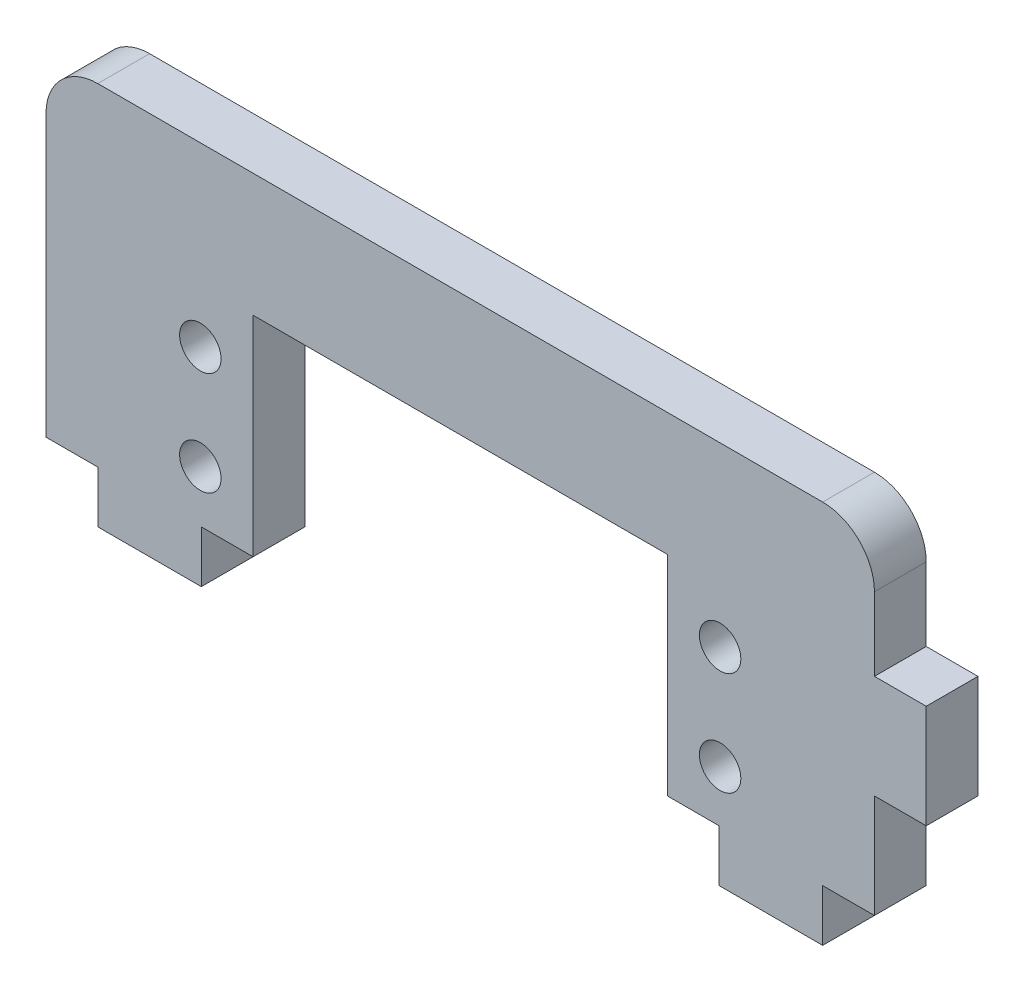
ISO-10303-21;
HEADER;
FILE_DESCRIPTION(('STEP AP214'),'2;1');
FILE_NAME('part.step','',(''),(''),'','','');
FILE_SCHEMA(('AUTOMOTIVE_DESIGN { 1 0 10303 214 1 1 1 1 }'));
ENDSEC;
DATA;
#1=APPLICATION_CONTEXT('core data for automotive mechanical design processes');
#2=APPLICATION_PROTOCOL_DEFINITION('international standard','automotive_design',2000,#1);
#3=PRODUCT_CONTEXT('',#1,'mechanical');
#4=PRODUCT('Part','Part','',(#3));
#5=PRODUCT_RELATED_PRODUCT_CATEGORY('part','',(#4));
#6=PRODUCT_DEFINITION_FORMATION('','',#4);
#7=PRODUCT_DEFINITION_CONTEXT('part definition',#1,'design');
#8=PRODUCT_DEFINITION('design','',#6,#7);
#9=PRODUCT_DEFINITION_SHAPE('','',#8);
#10=(LENGTH_UNIT() NAMED_UNIT(*) SI_UNIT(.MILLI.,.METRE.));
#11=(NAMED_UNIT(*) PLANE_ANGLE_UNIT() SI_UNIT($,.RADIAN.));
#12=(NAMED_UNIT(*) SI_UNIT($,.STERADIAN.) SOLID_ANGLE_UNIT());
#13=UNCERTAINTY_MEASURE_WITH_UNIT(LENGTH_MEASURE(1.E-05),#10,'distance_accuracy_value','');
#14=(GEOMETRIC_REPRESENTATION_CONTEXT(3) GLOBAL_UNCERTAINTY_ASSIGNED_CONTEXT((#13)) GLOBAL_UNIT_ASSIGNED_CONTEXT((#10,
#11,#12)) REPRESENTATION_CONTEXT('',''));
#15=CARTESIAN_POINT('',(0.,0.,0.));
#16=DIRECTION('',(0.,0.,1.));
#17=DIRECTION('',(1.,0.,0.));
#18=AXIS2_PLACEMENT_3D('',#15,#16,#17);
#19=CARTESIAN_POINT('',(80.,0.,5.));
#20=DIRECTION('',(-1.,0.,0.));
#21=DIRECTION('',(0.,0.,1.));
#22=AXIS2_PLACEMENT_3D('',#19,#20,#21);
#23=PLANE('',#22);
#24=DIRECTION('',(0.,0.,-1.));
#25=VECTOR('',#24,1.);
#26=CARTESIAN_POINT('',(80.,10.,5.));
#27=LINE('',#26,#25);
#28=CARTESIAN_POINT('',(80.,10.,5.));
#29=VERTEX_POINT('',#28);
#30=CARTESIAN_POINT('',(80.,10.,0.));
#31=VERTEX_POINT('',#30);
#32=EDGE_CURVE('E56',#29,#31,#27,.T.);
#33=ORIENTED_EDGE('',*,*,#32,.F.);
#34=DIRECTION('',(0.,1.,0.));
#35=VECTOR('',#34,1.);
#36=CARTESIAN_POINT('',(80.,0.,5.));
#37=LINE('',#36,#35);
#38=CARTESIAN_POINT('',(80.,0.,5.));
#39=VERTEX_POINT('',#38);
#40=EDGE_CURVE('E207',#39,#29,#37,.T.);
#41=ORIENTED_EDGE('',*,*,#40,.F.);
#42=DIRECTION('',(0.,0.,-1.));
#43=VECTOR('',#42,1.);
#44=CARTESIAN_POINT('',(80.,0.,5.));
#45=LINE('',#44,#43);
#46=CARTESIAN_POINT('',(80.,0.,0.));
#47=VERTEX_POINT('',#46);
#48=EDGE_CURVE('E350',#39,#47,#45,.T.);
#49=ORIENTED_EDGE('',*,*,#48,.T.);
#50=DIRECTION('',(0.,1.,0.));
#51=VECTOR('',#50,1.);
#52=CARTESIAN_POINT('',(80.,0.,0.));
#53=LINE('',#52,#51);
#54=EDGE_CURVE('E332',#47,#31,#53,.T.);
#55=ORIENTED_EDGE('',*,*,#54,.T.);
#56=EDGE_LOOP('',(#33,#41,#49,#55));
#57=FACE_BOUND('',#56,.T.);
#58=ADVANCED_FACE('F33',(#57),#23,.F.);
#59=DIRECTION('',(0.,0.,1.));
#60=VECTOR('',#59,1.);
#61=CARTESIAN_POINT('',(80.,20.,5.));
#62=LINE('',#61,#60);
#63=CARTESIAN_POINT('',(80.,20.,0.));
#64=VERTEX_POINT('',#63);
#65=CARTESIAN_POINT('',(80.,20.,5.));
#66=VERTEX_POINT('',#65);
#67=EDGE_CURVE('E203',#64,#66,#62,.T.);
#68=ORIENTED_EDGE('',*,*,#67,.F.);
#69=CARTESIAN_POINT('',(80.,27.0753073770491,0.));
#70=VERTEX_POINT('',#69);
#71=EDGE_CURVE('E331',#64,#70,#53,.T.);
#72=ORIENTED_EDGE('',*,*,#71,.T.);
#73=DIRECTION('',(0.,0.,-1.));
#74=VECTOR('',#73,1.);
#75=CARTESIAN_POINT('',(80.,27.0753073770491,5.));
#76=LINE('',#75,#74);
#77=CARTESIAN_POINT('',(80.,27.0753073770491,5.));
#78=VERTEX_POINT('',#77);
#79=EDGE_CURVE('E347',#78,#70,#76,.T.);
#80=ORIENTED_EDGE('',*,*,#79,.F.);
#81=EDGE_CURVE('E48',#66,#78,#37,.T.);
#82=ORIENTED_EDGE('',*,*,#81,.F.);
#83=EDGE_LOOP('',(#68,#72,#80,#82));
#84=FACE_BOUND('',#83,.T.);
#85=ADVANCED_FACE('F422',(#84),#23,.F.);
#86=CARTESIAN_POINT('',(60.,0.,5.));
#87=DIRECTION('',(0.,1.,0.));
#88=DIRECTION('',(0.,0.,1.));
#89=AXIS2_PLACEMENT_3D('',#86,#87,#88);
#90=PLANE('',#89);
#91=DIRECTION('',(0.,0.,-1.));
#92=VECTOR('',#91,1.);
#93=CARTESIAN_POINT('',(65.,0.,5.));
#94=LINE('',#93,#92);
#95=CARTESIAN_POINT('',(65.,0.,5.));
#96=VERTEX_POINT('',#95);
#97=CARTESIAN_POINT('',(65.,0.,0.));
#98=VERTEX_POINT('',#97);
#99=EDGE_CURVE('E208',#96,#98,#94,.T.);
#100=ORIENTED_EDGE('',*,*,#99,.F.);
#101=DIRECTION('',(1.,0.,0.));
#102=VECTOR('',#101,1.);
#103=CARTESIAN_POINT('',(60.,0.,5.));
#104=LINE('',#103,#102);
#105=CARTESIAN_POINT('',(60.,0.,5.));
#106=VERTEX_POINT('',#105);
#107=EDGE_CURVE('E306',#106,#96,#104,.T.);
#108=ORIENTED_EDGE('',*,*,#107,.F.);
#109=DIRECTION('',(0.,0.,-1.));
#110=VECTOR('',#109,1.);
#111=CARTESIAN_POINT('',(60.,0.,5.));
#112=LINE('',#111,#110);
#113=CARTESIAN_POINT('',(60.,0.,0.));
#114=VERTEX_POINT('',#113);
#115=EDGE_CURVE('E353',#106,#114,#112,.T.);
#116=ORIENTED_EDGE('',*,*,#115,.T.);
#117=DIRECTION('',(1.,0.,0.));
#118=VECTOR('',#117,1.);
#119=CARTESIAN_POINT('',(60.,0.,0.));
#120=LINE('',#119,#118);
#121=EDGE_CURVE('E329',#114,#98,#120,.T.);
#122=ORIENTED_EDGE('',*,*,#121,.T.);
#123=EDGE_LOOP('',(#100,#108,#116,#122));
#124=FACE_BOUND('',#123,.T.);
#125=ADVANCED_FACE('F449',(#124),#90,.F.);
#126=DIRECTION('',(0.,0.,1.));
#127=VECTOR('',#126,1.);
#128=CARTESIAN_POINT('',(75.,0.,5.));
#129=LINE('',#128,#127);
#130=CARTESIAN_POINT('',(75.,0.,0.));
#131=VERTEX_POINT('',#130);
#132=CARTESIAN_POINT('',(75.,0.,5.));
#133=VERTEX_POINT('',#132);
#134=EDGE_CURVE('E211',#131,#133,#129,.T.);
#135=ORIENTED_EDGE('',*,*,#134,.F.);
#136=EDGE_CURVE('E328',#131,#47,#120,.T.);
#137=ORIENTED_EDGE('',*,*,#136,.T.);
#138=ORIENTED_EDGE('',*,*,#48,.F.);
#139=EDGE_CURVE('E305',#133,#39,#104,.T.);
#140=ORIENTED_EDGE('',*,*,#139,.F.);
#141=EDGE_LOOP('',(#135,#137,#138,#140));
#142=FACE_BOUND('',#141,.T.);
#143=ADVANCED_FACE('F436',(#142),#90,.F.);
#144=CARTESIAN_POINT('',(0.,0.,5.));
#145=DIRECTION('',(0.,1.,0.));
#146=DIRECTION('',(0.,0.,1.));
#147=AXIS2_PLACEMENT_3D('',#144,#145,#146);
#148=PLANE('',#147);
#149=DIRECTION('',(0.,0.,-1.));
#150=VECTOR('',#149,1.);
#151=CARTESIAN_POINT('',(5.,0.,5.));
#152=LINE('',#151,#150);
#153=CARTESIAN_POINT('',(5.,0.,5.));
#154=VERTEX_POINT('',#153);
#155=CARTESIAN_POINT('',(5.,0.,0.));
#156=VERTEX_POINT('',#155);
#157=EDGE_CURVE('E240',#154,#156,#152,.T.);
#158=ORIENTED_EDGE('',*,*,#157,.F.);
#159=DIRECTION('',(1.,0.,0.));
#160=VECTOR('',#159,1.);
#161=CARTESIAN_POINT('',(0.,0.,5.));
#162=LINE('',#161,#160);
#163=CARTESIAN_POINT('',(0.,0.,5.));
#164=VERTEX_POINT('',#163);
#165=EDGE_CURVE('E296',#164,#154,#162,.T.);
#166=ORIENTED_EDGE('',*,*,#165,.F.);
#167=DIRECTION('',(0.,0.,-1.));
#168=VECTOR('',#167,1.);
#169=CARTESIAN_POINT('',(0.,0.,5.));
#170=LINE('',#169,#168);
#171=CARTESIAN_POINT('',(0.,0.,0.));
#172=VERTEX_POINT('',#171);
#173=EDGE_CURVE('E11',#164,#172,#170,.T.);
#174=ORIENTED_EDGE('',*,*,#173,.T.);
#175=DIRECTION('',(1.,0.,0.));
#176=VECTOR('',#175,1.);
#177=CARTESIAN_POINT('',(0.,0.,0.));
#178=LINE('',#177,#176);
#179=EDGE_CURVE('E320',#172,#156,#178,.T.);
#180=ORIENTED_EDGE('',*,*,#179,.T.);
#181=EDGE_LOOP('',(#158,#166,#174,#180));
#182=FACE_BOUND('',#181,.T.);
#183=ADVANCED_FACE('F401',(#182),#148,.F.);
#184=DIRECTION('',(0.,0.,1.));
#185=VECTOR('',#184,1.);
#186=CARTESIAN_POINT('',(15.,0.,5.));
#187=LINE('',#186,#185);
#188=CARTESIAN_POINT('',(15.,0.,0.));
#189=VERTEX_POINT('',#188);
#190=CARTESIAN_POINT('',(15.,0.,5.));
#191=VERTEX_POINT('',#190);
#192=EDGE_CURVE('E245',#189,#191,#187,.T.);
#193=ORIENTED_EDGE('',*,*,#192,.F.);
#194=CARTESIAN_POINT('',(20.,0.,0.));
#195=VERTEX_POINT('',#194);
#196=EDGE_CURVE('E319',#189,#195,#178,.T.);
#197=ORIENTED_EDGE('',*,*,#196,.T.);
#198=DIRECTION('',(0.,0.,-1.));
#199=VECTOR('',#198,1.);
#200=CARTESIAN_POINT('',(20.,0.,5.));
#201=LINE('',#200,#199);
#202=CARTESIAN_POINT('',(20.,0.,5.));
#203=VERTEX_POINT('',#202);
#204=EDGE_CURVE('E41',#203,#195,#201,.T.);
#205=ORIENTED_EDGE('',*,*,#204,.F.);
#206=EDGE_CURVE('E294',#191,#203,#162,.T.);
#207=ORIENTED_EDGE('',*,*,#206,.F.);
#208=EDGE_LOOP('',(#193,#197,#205,#207));
#209=FACE_BOUND('',#208,.T.);
#210=ADVANCED_FACE('F389',(#209),#148,.F.);
#211=CARTESIAN_POINT('',(0.,0.,5.));
#212=DIRECTION('',(1.,0.,0.));
#213=DIRECTION('',(0.,0.,-1.));
#214=AXIS2_PLACEMENT_3D('',#211,#212,#213);
#215=PLANE('',#214);
#216=DIRECTION('',(0.,-1.,0.));
#217=VECTOR('',#216,1.);
#218=CARTESIAN_POINT('',(0.,0.,0.));
#219=LINE('',#218,#217);
#220=CARTESIAN_POINT('',(0.,27.0753073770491,0.));
#221=VERTEX_POINT('',#220);
#222=EDGE_CURVE('E289',#221,#172,#219,.T.);
#223=ORIENTED_EDGE('',*,*,#222,.T.);
#224=ORIENTED_EDGE('',*,*,#173,.F.);
#225=DIRECTION('',(0.,-1.,0.));
#226=VECTOR('',#225,1.);
#227=CARTESIAN_POINT('',(0.,0.,5.));
#228=LINE('',#227,#226);
#229=CARTESIAN_POINT('',(0.,27.0753073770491,5.));
#230=VERTEX_POINT('',#229);
#231=EDGE_CURVE('E292',#230,#164,#228,.T.);
#232=ORIENTED_EDGE('',*,*,#231,.F.);
#233=DIRECTION('',(0.,0.,-1.));
#234=VECTOR('',#233,1.);
#235=CARTESIAN_POINT('',(0.,27.0753073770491,5.));
#236=LINE('',#235,#234);
#237=EDGE_CURVE('E316',#230,#221,#236,.T.);
#238=ORIENTED_EDGE('',*,*,#237,.T.);
#239=EDGE_LOOP('',(#223,#224,#232,#238));
#240=FACE_BOUND('',#239,.T.);
#241=ADVANCED_FACE('F35',(#240),#215,.F.);
#242=CARTESIAN_POINT('',(20.,0.,5.));
#243=DIRECTION('',(-1.,0.,0.));
#244=DIRECTION('',(0.,0.,1.));
#245=AXIS2_PLACEMENT_3D('',#242,#243,#244);
#246=PLANE('',#245);
#247=DIRECTION('',(0.,1.,0.));
#248=VECTOR('',#247,1.);
#249=CARTESIAN_POINT('',(20.,0.,0.));
#250=LINE('',#249,#248);
#251=CARTESIAN_POINT('',(20.,20.2,0.));
#252=VERTEX_POINT('',#251);
#253=EDGE_CURVE('E322',#195,#252,#250,.T.);
#254=ORIENTED_EDGE('',*,*,#253,.T.);
#255=DIRECTION('',(0.,0.,-1.));
#256=VECTOR('',#255,1.);
#257=CARTESIAN_POINT('',(20.,20.2,5.));
#258=LINE('',#257,#256);
#259=CARTESIAN_POINT('',(20.,20.2,5.));
#260=VERTEX_POINT('',#259);
#261=EDGE_CURVE('E359',#260,#252,#258,.T.);
#262=ORIENTED_EDGE('',*,*,#261,.F.);
#263=DIRECTION('',(0.,1.,0.));
#264=VECTOR('',#263,1.);
#265=CARTESIAN_POINT('',(20.,0.,5.));
#266=LINE('',#265,#264);
#267=EDGE_CURVE('E299',#203,#260,#266,.T.);
#268=ORIENTED_EDGE('',*,*,#267,.F.);
#269=ORIENTED_EDGE('',*,*,#204,.T.);
#270=EDGE_LOOP('',(#254,#262,#268,#269));
#271=FACE_BOUND('',#270,.T.);
#272=ADVANCED_FACE('F366',(#271),#246,.F.);
#273=CARTESIAN_POINT('',(20.,20.2,5.));
#274=DIRECTION('',(0.,1.,0.));
#275=DIRECTION('',(0.,0.,1.));
#276=AXIS2_PLACEMENT_3D('',#273,#274,#275);
#277=PLANE('',#276);
#278=DIRECTION('',(1.,0.,0.));
#279=VECTOR('',#278,1.);
#280=CARTESIAN_POINT('',(20.,20.2,0.));
#281=LINE('',#280,#279);
#282=CARTESIAN_POINT('',(60.,20.2,0.));
#283=VERTEX_POINT('',#282);
#284=EDGE_CURVE('E324',#252,#283,#281,.T.);
#285=ORIENTED_EDGE('',*,*,#284,.T.);
#286=DIRECTION('',(0.,0.,-1.));
#287=VECTOR('',#286,1.);
#288=CARTESIAN_POINT('',(60.,20.2,5.));
#289=LINE('',#288,#287);
#290=CARTESIAN_POINT('',(60.,20.2,5.));
#291=VERTEX_POINT('',#290);
#292=EDGE_CURVE('E356',#291,#283,#289,.T.);
#293=ORIENTED_EDGE('',*,*,#292,.F.);
#294=DIRECTION('',(1.,0.,0.));
#295=VECTOR('',#294,1.);
#296=CARTESIAN_POINT('',(20.,20.2,5.));
#297=LINE('',#296,#295);
#298=EDGE_CURVE('E301',#260,#291,#297,.T.);
#299=ORIENTED_EDGE('',*,*,#298,.F.);
#300=ORIENTED_EDGE('',*,*,#261,.T.);
#301=EDGE_LOOP('',(#285,#293,#299,#300));
#302=FACE_BOUND('',#301,.T.);
#303=ADVANCED_FACE('F379',(#302),#277,.F.);
#304=CARTESIAN_POINT('',(60.,0.,5.));
#305=DIRECTION('',(1.,0.,0.));
#306=DIRECTION('',(0.,0.,-1.));
#307=AXIS2_PLACEMENT_3D('',#304,#305,#306);
#308=PLANE('',#307);
#309=DIRECTION('',(0.,-1.,0.));
#310=VECTOR('',#309,1.);
#311=CARTESIAN_POINT('',(60.,0.,0.));
#312=LINE('',#311,#310);
#313=EDGE_CURVE('E326',#283,#114,#312,.T.);
#314=ORIENTED_EDGE('',*,*,#313,.T.);
#315=ORIENTED_EDGE('',*,*,#115,.F.);
#316=DIRECTION('',(0.,-1.,0.));
#317=VECTOR('',#316,1.);
#318=CARTESIAN_POINT('',(60.,0.,5.));
#319=LINE('',#318,#317);
#320=EDGE_CURVE('E303',#291,#106,#319,.T.);
#321=ORIENTED_EDGE('',*,*,#320,.F.);
#322=ORIENTED_EDGE('',*,*,#292,.T.);
#323=EDGE_LOOP('',(#314,#315,#321,#322));
#324=FACE_BOUND('',#323,.T.);
#325=ADVANCED_FACE('F383',(#324),#308,.F.);
#326=CARTESIAN_POINT('',(75.,27.0753073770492,5.));
#327=DIRECTION('',(0.,0.,-1.));
#328=DIRECTION('',(-1.,0.,0.));
#329=AXIS2_PLACEMENT_3D('',#326,#327,#328);
#330=CYLINDRICAL_SURFACE('',#329,5.);
#331=CARTESIAN_POINT('',(75.,27.0753073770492,0.));
#332=DIRECTION('',(0.,0.,1.));
#333=DIRECTION('',(-1.,0.,0.));
#334=AXIS2_PLACEMENT_3D('',#331,#332,#333);
#335=CIRCLE('',#334,5.);
#336=CARTESIAN_POINT('',(75.,32.0753073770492,0.));
#337=VERTEX_POINT('',#336);
#338=EDGE_CURVE('E334',#70,#337,#335,.T.);
#339=ORIENTED_EDGE('',*,*,#338,.T.);
#340=DIRECTION('',(0.,0.,-1.));
#341=VECTOR('',#340,1.);
#342=CARTESIAN_POINT('',(75.,32.0753073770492,5.));
#343=LINE('',#342,#341);
#344=CARTESIAN_POINT('',(75.,32.0753073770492,5.));
#345=VERTEX_POINT('',#344);
#346=EDGE_CURVE('E344',#345,#337,#343,.T.);
#347=ORIENTED_EDGE('',*,*,#346,.F.);
#348=CARTESIAN_POINT('',(75.,27.0753073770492,5.));
#349=DIRECTION('',(0.,0.,1.));
#350=DIRECTION('',(-1.,0.,0.));
#351=AXIS2_PLACEMENT_3D('',#348,#349,#350);
#352=CIRCLE('',#351,5.);
#353=EDGE_CURVE('E310',#78,#345,#352,.T.);
#354=ORIENTED_EDGE('',*,*,#353,.F.);
#355=ORIENTED_EDGE('',*,*,#79,.T.);
#356=EDGE_LOOP('',(#339,#347,#354,#355));
#357=FACE_BOUND('',#356,.T.);
#358=ADVANCED_FACE('F419',(#357),#330,.T.);
#359=CARTESIAN_POINT('',(5.00000000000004,32.0753073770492,5.));
#360=DIRECTION('',(0.,-1.,0.));
#361=DIRECTION('',(0.,0.,-1.));
#362=AXIS2_PLACEMENT_3D('',#359,#360,#361);
#363=PLANE('',#362);
#364=DIRECTION('',(-1.,0.,0.));
#365=VECTOR('',#364,1.);
#366=CARTESIAN_POINT('',(5.00000000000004,32.0753073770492,0.));
#367=LINE('',#366,#365);
#368=CARTESIAN_POINT('',(5.00000000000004,32.0753073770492,0.));
#369=VERTEX_POINT('',#368);
#370=EDGE_CURVE('E336',#337,#369,#367,.T.);
#371=ORIENTED_EDGE('',*,*,#370,.T.);
#372=DIRECTION('',(0.,0.,-1.));
#373=VECTOR('',#372,1.);
#374=CARTESIAN_POINT('',(5.00000000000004,32.0753073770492,5.));
#375=LINE('',#374,#373);
#376=CARTESIAN_POINT('',(5.00000000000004,32.0753073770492,5.));
#377=VERTEX_POINT('',#376);
#378=EDGE_CURVE('E341',#377,#369,#375,.T.);
#379=ORIENTED_EDGE('',*,*,#378,.F.);
#380=DIRECTION('',(-1.,0.,0.));
#381=VECTOR('',#380,1.);
#382=CARTESIAN_POINT('',(5.00000000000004,32.0753073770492,5.));
#383=LINE('',#382,#381);
#384=EDGE_CURVE('E312',#345,#377,#383,.T.);
#385=ORIENTED_EDGE('',*,*,#384,.F.);
#386=ORIENTED_EDGE('',*,*,#346,.T.);
#387=EDGE_LOOP('',(#371,#379,#385,#386));
#388=FACE_BOUND('',#387,.T.);
#389=ADVANCED_FACE('F415',(#388),#363,.F.);
#390=CARTESIAN_POINT('',(5.,27.0753073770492,5.));
#391=DIRECTION('',(0.,0.,-1.));
#392=DIRECTION('',(-1.,0.,0.));
#393=AXIS2_PLACEMENT_3D('',#390,#391,#392);
#394=CYLINDRICAL_SURFACE('',#393,5.);
#395=CARTESIAN_POINT('',(5.,27.0753073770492,0.));
#396=DIRECTION('',(0.,0.,1.));
#397=DIRECTION('',(-1.,0.,0.));
#398=AXIS2_PLACEMENT_3D('',#395,#396,#397);
#399=CIRCLE('',#398,5.);
#400=EDGE_CURVE('E295',#369,#221,#399,.T.);
#401=ORIENTED_EDGE('',*,*,#400,.T.);
#402=ORIENTED_EDGE('',*,*,#237,.F.);
#403=CARTESIAN_POINT('',(5.,27.0753073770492,5.));
#404=DIRECTION('',(0.,0.,1.));
#405=DIRECTION('',(-1.,0.,0.));
#406=AXIS2_PLACEMENT_3D('',#403,#404,#405);
#407=CIRCLE('',#406,5.);
#408=EDGE_CURVE('E314',#377,#230,#407,.T.);
#409=ORIENTED_EDGE('',*,*,#408,.F.);
#410=ORIENTED_EDGE('',*,*,#378,.T.);
#411=EDGE_LOOP('',(#401,#402,#409,#410));
#412=FACE_BOUND('',#411,.T.);
#413=ADVANCED_FACE('F411',(#412),#394,.T.);
#414=CARTESIAN_POINT('',(5.,27.0753073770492,5.));
#415=DIRECTION('',(0.,0.,-1.));
#416=DIRECTION('',(-1.,0.,0.));
#417=AXIS2_PLACEMENT_3D('',#414,#415,#416);
#418=PLANE('',#417);
#419=CARTESIAN_POINT('',(14.9028967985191,15.,5.));
#420=DIRECTION('',(0.,0.,1.));
#421=DIRECTION('',(-1.,0.,0.));
#422=AXIS2_PLACEMENT_3D('',#419,#420,#421);
#423=CIRCLE('',#422,2.);
#424=CARTESIAN_POINT('',(12.9028967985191,15.,5.));
#425=VERTEX_POINT('',#424);
#426=EDGE_CURVE('E267',#425,#425,#423,.T.);
#427=ORIENTED_EDGE('',*,*,#426,.F.);
#428=EDGE_LOOP('',(#427));
#429=FACE_BOUND('',#428,.T.);
#430=CARTESIAN_POINT('',(14.9028967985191,4.99999999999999,5.));
#431=DIRECTION('',(0.,0.,1.));
#432=DIRECTION('',(-1.,0.,0.));
#433=AXIS2_PLACEMENT_3D('',#430,#431,#432);
#434=CIRCLE('',#433,2.);
#435=CARTESIAN_POINT('',(12.9028967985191,4.99999999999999,5.));
#436=VERTEX_POINT('',#435);
#437=EDGE_CURVE('E271',#436,#436,#434,.T.);
#438=ORIENTED_EDGE('',*,*,#437,.F.);
#439=EDGE_LOOP('',(#438));
#440=FACE_BOUND('',#439,.T.);
#441=CARTESIAN_POINT('',(65.0971032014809,5.,5.));
#442=DIRECTION('',(0.,0.,1.));
#443=DIRECTION('',(1.,0.,0.));
#444=AXIS2_PLACEMENT_3D('',#441,#442,#443);
#445=CIRCLE('',#444,2.);
#446=CARTESIAN_POINT('',(67.0971032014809,5.,5.));
#447=VERTEX_POINT('',#446);
#448=EDGE_CURVE('E277',#447,#447,#445,.T.);
#449=ORIENTED_EDGE('',*,*,#448,.F.);
#450=EDGE_LOOP('',(#449));
#451=FACE_BOUND('',#450,.T.);
#452=CARTESIAN_POINT('',(65.0971032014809,15.,5.));
#453=DIRECTION('',(0.,0.,1.));
#454=DIRECTION('',(1.,0.,0.));
#455=AXIS2_PLACEMENT_3D('',#452,#453,#454);
#456=CIRCLE('',#455,2.);
#457=CARTESIAN_POINT('',(67.0971032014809,15.,5.));
#458=VERTEX_POINT('',#457);
#459=EDGE_CURVE('E283',#458,#458,#456,.T.);
#460=ORIENTED_EDGE('',*,*,#459,.F.);
#461=EDGE_LOOP('',(#460));
#462=FACE_BOUND('',#461,.T.);
#463=ORIENTED_EDGE('',*,*,#231,.T.);
#464=ORIENTED_EDGE('',*,*,#165,.T.);
#465=DIRECTION('',(0.,1.,0.));
#466=VECTOR('',#465,1.);
#467=CARTESIAN_POINT('',(5.,-5.,5.));
#468=LINE('',#467,#466);
#469=CARTESIAN_POINT('',(5.,-5.,5.));
#470=VERTEX_POINT('',#469);
#471=EDGE_CURVE('E251',#470,#154,#468,.T.);
#472=ORIENTED_EDGE('',*,*,#471,.F.);
#473=DIRECTION('',(-1.,0.,0.));
#474=VECTOR('',#473,1.);
#475=CARTESIAN_POINT('',(5.,-5.,5.));
#476=LINE('',#475,#474);
#477=CARTESIAN_POINT('',(15.,-5.,5.));
#478=VERTEX_POINT('',#477);
#479=EDGE_CURVE('E249',#478,#470,#476,.T.);
#480=ORIENTED_EDGE('',*,*,#479,.F.);
#481=DIRECTION('',(0.,1.,0.));
#482=VECTOR('',#481,1.);
#483=CARTESIAN_POINT('',(15.,-5.,5.));
#484=LINE('',#483,#482);
#485=EDGE_CURVE('E258',#478,#191,#484,.T.);
#486=ORIENTED_EDGE('',*,*,#485,.T.);
#487=ORIENTED_EDGE('',*,*,#206,.T.);
#488=ORIENTED_EDGE('',*,*,#267,.T.);
#489=ORIENTED_EDGE('',*,*,#298,.T.);
#490=ORIENTED_EDGE('',*,*,#320,.T.);
#491=ORIENTED_EDGE('',*,*,#107,.T.);
#492=DIRECTION('',(0.,1.,0.));
#493=VECTOR('',#492,1.);
#494=CARTESIAN_POINT('',(65.,-5.,5.));
#495=LINE('',#494,#493);
#496=CARTESIAN_POINT('',(65.,-5.,5.));
#497=VERTEX_POINT('',#496);
#498=EDGE_CURVE('E225',#497,#96,#495,.T.);
#499=ORIENTED_EDGE('',*,*,#498,.F.);
#500=DIRECTION('',(-1.,0.,0.));
#501=VECTOR('',#500,1.);
#502=CARTESIAN_POINT('',(65.,-5.,5.));
#503=LINE('',#502,#501);
#504=CARTESIAN_POINT('',(75.,-5.,5.));
#505=VERTEX_POINT('',#504);
#506=EDGE_CURVE('E224',#505,#497,#503,.T.);
#507=ORIENTED_EDGE('',*,*,#506,.F.);
#508=DIRECTION('',(0.,1.,0.));
#509=VECTOR('',#508,1.);
#510=CARTESIAN_POINT('',(75.,-5.,5.));
#511=LINE('',#510,#509);
#512=EDGE_CURVE('E231',#505,#133,#511,.T.);
#513=ORIENTED_EDGE('',*,*,#512,.T.);
#514=ORIENTED_EDGE('',*,*,#139,.T.);
#515=ORIENTED_EDGE('',*,*,#40,.T.);
#516=DIRECTION('',(-1.,0.,0.));
#517=VECTOR('',#516,1.);
#518=CARTESIAN_POINT('',(85.,10.,5.));
#519=LINE('',#518,#517);
#520=CARTESIAN_POINT('',(85.,10.,5.));
#521=VERTEX_POINT('',#520);
#522=EDGE_CURVE('E188',#521,#29,#519,.T.);
#523=ORIENTED_EDGE('',*,*,#522,.F.);
#524=DIRECTION('',(0.,-1.,0.));
#525=VECTOR('',#524,1.);
#526=CARTESIAN_POINT('',(85.,20.,5.));
#527=LINE('',#526,#525);
#528=CARTESIAN_POINT('',(85.,20.,5.));
#529=VERTEX_POINT('',#528);
#530=EDGE_CURVE('E194',#529,#521,#527,.T.);
#531=ORIENTED_EDGE('',*,*,#530,.F.);
#532=DIRECTION('',(-1.,0.,0.));
#533=VECTOR('',#532,1.);
#534=CARTESIAN_POINT('',(85.,20.,5.));
#535=LINE('',#534,#533);
#536=EDGE_CURVE('E426',#529,#66,#535,.T.);
#537=ORIENTED_EDGE('',*,*,#536,.T.);
#538=ORIENTED_EDGE('',*,*,#81,.T.);
#539=ORIENTED_EDGE('',*,*,#353,.T.);
#540=ORIENTED_EDGE('',*,*,#384,.T.);
#541=ORIENTED_EDGE('',*,*,#408,.T.);
#542=EDGE_LOOP('',(#463,#464,#472,#480,#486,#487,#488,#489,#490,#491,#499,#507,#513,#514,#515,
#523,#531,#537,#538,#539,#540,#541));
#543=FACE_BOUND('',#542,.T.);
#544=ADVANCED_FACE('F206',(#429,#440,#451,#462,#543),#418,.F.);
#545=CARTESIAN_POINT('',(5.,27.0753073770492,0.));
#546=DIRECTION('',(0.,0.,-1.));
#547=DIRECTION('',(-1.,0.,0.));
#548=AXIS2_PLACEMENT_3D('',#545,#546,#547);
#549=PLANE('',#548);
#550=CARTESIAN_POINT('',(14.9028967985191,15.,0.));
#551=DIRECTION('',(0.,0.,1.));
#552=DIRECTION('',(-1.,0.,0.));
#553=AXIS2_PLACEMENT_3D('',#550,#551,#552);
#554=CIRCLE('',#553,2.);
#555=CARTESIAN_POINT('',(12.9028967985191,15.,0.));
#556=VERTEX_POINT('',#555);
#557=EDGE_CURVE('E268',#556,#556,#554,.T.);
#558=ORIENTED_EDGE('',*,*,#557,.T.);
#559=EDGE_LOOP('',(#558));
#560=FACE_BOUND('',#559,.T.);
#561=CARTESIAN_POINT('',(14.9028967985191,4.99999999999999,0.));
#562=DIRECTION('',(0.,0.,1.));
#563=DIRECTION('',(-1.,0.,0.));
#564=AXIS2_PLACEMENT_3D('',#561,#562,#563);
#565=CIRCLE('',#564,2.);
#566=CARTESIAN_POINT('',(12.9028967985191,4.99999999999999,0.));
#567=VERTEX_POINT('',#566);
#568=EDGE_CURVE('E274',#567,#567,#565,.T.);
#569=ORIENTED_EDGE('',*,*,#568,.T.);
#570=EDGE_LOOP('',(#569));
#571=FACE_BOUND('',#570,.T.);
#572=CARTESIAN_POINT('',(65.0971032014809,5.,0.));
#573=DIRECTION('',(0.,0.,1.));
#574=DIRECTION('',(1.,0.,0.));
#575=AXIS2_PLACEMENT_3D('',#572,#573,#574);
#576=CIRCLE('',#575,2.);
#577=CARTESIAN_POINT('',(67.0971032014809,5.,0.));
#578=VERTEX_POINT('',#577);
#579=EDGE_CURVE('E280',#578,#578,#576,.T.);
#580=ORIENTED_EDGE('',*,*,#579,.T.);
#581=EDGE_LOOP('',(#580));
#582=FACE_BOUND('',#581,.T.);
#583=CARTESIAN_POINT('',(65.0971032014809,15.,0.));
#584=DIRECTION('',(0.,0.,1.));
#585=DIRECTION('',(1.,0.,0.));
#586=AXIS2_PLACEMENT_3D('',#583,#584,#585);
#587=CIRCLE('',#586,2.);
#588=CARTESIAN_POINT('',(67.0971032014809,15.,0.));
#589=VERTEX_POINT('',#588);
#590=EDGE_CURVE('E286',#589,#589,#587,.T.);
#591=ORIENTED_EDGE('',*,*,#590,.T.);
#592=EDGE_LOOP('',(#591));
#593=FACE_BOUND('',#592,.T.);
#594=ORIENTED_EDGE('',*,*,#222,.F.);
#595=ORIENTED_EDGE('',*,*,#400,.F.);
#596=ORIENTED_EDGE('',*,*,#370,.F.);
#597=ORIENTED_EDGE('',*,*,#338,.F.);
#598=ORIENTED_EDGE('',*,*,#71,.F.);
#599=DIRECTION('',(-1.,0.,0.));
#600=VECTOR('',#599,1.);
#601=CARTESIAN_POINT('',(85.,20.,0.));
#602=LINE('',#601,#600);
#603=CARTESIAN_POINT('',(85.,20.,0.));
#604=VERTEX_POINT('',#603);
#605=EDGE_CURVE('E213',#604,#64,#602,.T.);
#606=ORIENTED_EDGE('',*,*,#605,.F.);
#607=DIRECTION('',(0.,1.,0.));
#608=VECTOR('',#607,1.);
#609=CARTESIAN_POINT('',(85.,20.,0.));
#610=LINE('',#609,#608);
#611=CARTESIAN_POINT('',(85.,10.,0.));
#612=VERTEX_POINT('',#611);
#613=EDGE_CURVE('E193',#612,#604,#610,.T.);
#614=ORIENTED_EDGE('',*,*,#613,.F.);
#615=DIRECTION('',(-1.,0.,0.));
#616=VECTOR('',#615,1.);
#617=CARTESIAN_POINT('',(85.,10.,0.));
#618=LINE('',#617,#616);
#619=EDGE_CURVE('E190',#612,#31,#618,.T.);
#620=ORIENTED_EDGE('',*,*,#619,.T.);
#621=ORIENTED_EDGE('',*,*,#54,.F.);
#622=ORIENTED_EDGE('',*,*,#136,.F.);
#623=DIRECTION('',(0.,1.,0.));
#624=VECTOR('',#623,1.);
#625=CARTESIAN_POINT('',(75.,-5.,0.));
#626=LINE('',#625,#624);
#627=CARTESIAN_POINT('',(75.,-5.,0.));
#628=VERTEX_POINT('',#627);
#629=EDGE_CURVE('E234',#628,#131,#626,.T.);
#630=ORIENTED_EDGE('',*,*,#629,.F.);
#631=DIRECTION('',(1.,0.,0.));
#632=VECTOR('',#631,1.);
#633=CARTESIAN_POINT('',(65.,-5.,0.));
#634=LINE('',#633,#632);
#635=CARTESIAN_POINT('',(65.,-5.,0.));
#636=VERTEX_POINT('',#635);
#637=EDGE_CURVE('E220',#636,#628,#634,.T.);
#638=ORIENTED_EDGE('',*,*,#637,.F.);
#639=DIRECTION('',(0.,1.,0.));
#640=VECTOR('',#639,1.);
#641=CARTESIAN_POINT('',(65.,-5.,0.));
#642=LINE('',#641,#640);
#643=EDGE_CURVE('E237',#636,#98,#642,.T.);
#644=ORIENTED_EDGE('',*,*,#643,.T.);
#645=ORIENTED_EDGE('',*,*,#121,.F.);
#646=ORIENTED_EDGE('',*,*,#313,.F.);
#647=ORIENTED_EDGE('',*,*,#284,.F.);
#648=ORIENTED_EDGE('',*,*,#253,.F.);
#649=ORIENTED_EDGE('',*,*,#196,.F.);
#650=DIRECTION('',(0.,1.,0.));
#651=VECTOR('',#650,1.);
#652=CARTESIAN_POINT('',(15.,-5.,0.));
#653=LINE('',#652,#651);
#654=CARTESIAN_POINT('',(15.,-5.,0.));
#655=VERTEX_POINT('',#654);
#656=EDGE_CURVE('E261',#655,#189,#653,.T.);
#657=ORIENTED_EDGE('',*,*,#656,.F.);
#658=DIRECTION('',(1.,0.,0.));
#659=VECTOR('',#658,1.);
#660=CARTESIAN_POINT('',(5.,-5.,0.));
#661=LINE('',#660,#659);
#662=CARTESIAN_POINT('',(5.,-5.,0.));
#663=VERTEX_POINT('',#662);
#664=EDGE_CURVE('E244',#663,#655,#661,.T.);
#665=ORIENTED_EDGE('',*,*,#664,.F.);
#666=DIRECTION('',(0.,1.,0.));
#667=VECTOR('',#666,1.);
#668=CARTESIAN_POINT('',(5.,-5.,0.));
#669=LINE('',#668,#667);
#670=EDGE_CURVE('E264',#663,#156,#669,.T.);
#671=ORIENTED_EDGE('',*,*,#670,.T.);
#672=ORIENTED_EDGE('',*,*,#179,.F.);
#673=EDGE_LOOP('',(#594,#595,#596,#597,#598,#606,#614,#620,#621,#622,#630,#638,#644,#645,#646,
#647,#648,#649,#657,#665,#671,#672));
#674=FACE_BOUND('',#673,.T.);
#675=ADVANCED_FACE('F372',(#560,#571,#582,#593,#674),#549,.T.);
#676=CARTESIAN_POINT('',(65.0971032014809,15.,0.));
#677=DIRECTION('',(0.,0.,1.));
#678=DIRECTION('',(1.,0.,0.));
#679=AXIS2_PLACEMENT_3D('',#676,#677,#678);
#680=CYLINDRICAL_SURFACE('',#679,2.);
#681=ORIENTED_EDGE('',*,*,#590,.F.);
#682=EDGE_LOOP('',(#681));
#683=FACE_BOUND('',#682,.T.);
#684=ORIENTED_EDGE('',*,*,#459,.T.);
#685=EDGE_LOOP('',(#684));
#686=FACE_BOUND('',#685,.T.);
#687=ADVANCED_FACE('F471',(#683,#686),#680,.F.);
#688=CARTESIAN_POINT('',(65.0971032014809,5.,0.));
#689=DIRECTION('',(0.,0.,1.));
#690=DIRECTION('',(1.,0.,0.));
#691=AXIS2_PLACEMENT_3D('',#688,#689,#690);
#692=CYLINDRICAL_SURFACE('',#691,2.);
#693=ORIENTED_EDGE('',*,*,#579,.F.);
#694=EDGE_LOOP('',(#693));
#695=FACE_BOUND('',#694,.T.);
#696=ORIENTED_EDGE('',*,*,#448,.T.);
#697=EDGE_LOOP('',(#696));
#698=FACE_BOUND('',#697,.T.);
#699=ADVANCED_FACE('F478',(#695,#698),#692,.F.);
#700=CARTESIAN_POINT('',(14.9028967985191,4.99999999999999,0.));
#701=DIRECTION('',(0.,0.,1.));
#702=DIRECTION('',(1.,0.,0.));
#703=AXIS2_PLACEMENT_3D('',#700,#701,#702);
#704=CYLINDRICAL_SURFACE('',#703,2.);
#705=ORIENTED_EDGE('',*,*,#568,.F.);
#706=EDGE_LOOP('',(#705));
#707=FACE_BOUND('',#706,.T.);
#708=ORIENTED_EDGE('',*,*,#437,.T.);
#709=EDGE_LOOP('',(#708));
#710=FACE_BOUND('',#709,.T.);
#711=ADVANCED_FACE('F482',(#707,#710),#704,.F.);
#712=CARTESIAN_POINT('',(14.9028967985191,15.,0.));
#713=DIRECTION('',(0.,0.,1.));
#714=DIRECTION('',(1.,0.,0.));
#715=AXIS2_PLACEMENT_3D('',#712,#713,#714);
#716=CYLINDRICAL_SURFACE('',#715,2.);
#717=ORIENTED_EDGE('',*,*,#557,.F.);
#718=EDGE_LOOP('',(#717));
#719=FACE_BOUND('',#718,.T.);
#720=ORIENTED_EDGE('',*,*,#426,.T.);
#721=EDGE_LOOP('',(#720));
#722=FACE_BOUND('',#721,.T.);
#723=ADVANCED_FACE('F486',(#719,#722),#716,.F.);
#724=CARTESIAN_POINT('',(5.,-5.,5.));
#725=DIRECTION('',(1.,0.,0.));
#726=DIRECTION('',(0.,0.,-1.));
#727=AXIS2_PLACEMENT_3D('',#724,#725,#726);
#728=PLANE('',#727);
#729=ORIENTED_EDGE('',*,*,#157,.T.);
#730=ORIENTED_EDGE('',*,*,#670,.F.);
#731=DIRECTION('',(0.,0.,-1.));
#732=VECTOR('',#731,1.);
#733=CARTESIAN_POINT('',(5.,-5.,5.));
#734=LINE('',#733,#732);
#735=EDGE_CURVE('E241',#470,#663,#734,.T.);
#736=ORIENTED_EDGE('',*,*,#735,.F.);
#737=ORIENTED_EDGE('',*,*,#471,.T.);
#738=EDGE_LOOP('',(#729,#730,#736,#737));
#739=FACE_BOUND('',#738,.T.);
#740=ADVANCED_FACE('F399',(#739),#728,.F.);
#741=CARTESIAN_POINT('',(15.,-5.,5.));
#742=DIRECTION('',(-1.,0.,0.));
#743=DIRECTION('',(0.,0.,1.));
#744=AXIS2_PLACEMENT_3D('',#741,#742,#743);
#745=PLANE('',#744);
#746=ORIENTED_EDGE('',*,*,#192,.T.);
#747=ORIENTED_EDGE('',*,*,#485,.F.);
#748=DIRECTION('',(0.,0.,1.));
#749=VECTOR('',#748,1.);
#750=CARTESIAN_POINT('',(15.,-5.,5.));
#751=LINE('',#750,#749);
#752=EDGE_CURVE('E247',#655,#478,#751,.T.);
#753=ORIENTED_EDGE('',*,*,#752,.F.);
#754=ORIENTED_EDGE('',*,*,#656,.T.);
#755=EDGE_LOOP('',(#746,#747,#753,#754));
#756=FACE_BOUND('',#755,.T.);
#757=ADVANCED_FACE('F391',(#756),#745,.F.);
#758=CARTESIAN_POINT('',(0.,-5.,0.));
#759=DIRECTION('',(0.,-1.,0.));
#760=DIRECTION('',(0.,0.,-1.));
#761=AXIS2_PLACEMENT_3D('',#758,#759,#760);
#762=PLANE('',#761);
#763=ORIENTED_EDGE('',*,*,#735,.T.);
#764=ORIENTED_EDGE('',*,*,#664,.T.);
#765=ORIENTED_EDGE('',*,*,#752,.T.);
#766=ORIENTED_EDGE('',*,*,#479,.T.);
#767=EDGE_LOOP('',(#763,#764,#765,#766));
#768=FACE_BOUND('',#767,.T.);
#769=ADVANCED_FACE('F396',(#768),#762,.T.);
#770=CARTESIAN_POINT('',(65.,-5.,5.));
#771=DIRECTION('',(1.,0.,0.));
#772=DIRECTION('',(0.,0.,-1.));
#773=AXIS2_PLACEMENT_3D('',#770,#771,#772);
#774=PLANE('',#773);
#775=ORIENTED_EDGE('',*,*,#99,.T.);
#776=ORIENTED_EDGE('',*,*,#643,.F.);
#777=DIRECTION('',(0.,0.,-1.));
#778=VECTOR('',#777,1.);
#779=CARTESIAN_POINT('',(65.,-5.,5.));
#780=LINE('',#779,#778);
#781=EDGE_CURVE('E217',#497,#636,#780,.T.);
#782=ORIENTED_EDGE('',*,*,#781,.F.);
#783=ORIENTED_EDGE('',*,*,#498,.T.);
#784=EDGE_LOOP('',(#775,#776,#782,#783));
#785=FACE_BOUND('',#784,.T.);
#786=ADVANCED_FACE('F447',(#785),#774,.F.);
#787=CARTESIAN_POINT('',(75.,-5.,5.));
#788=DIRECTION('',(-1.,0.,0.));
#789=DIRECTION('',(0.,0.,1.));
#790=AXIS2_PLACEMENT_3D('',#787,#788,#789);
#791=PLANE('',#790);
#792=ORIENTED_EDGE('',*,*,#134,.T.);
#793=ORIENTED_EDGE('',*,*,#512,.F.);
#794=DIRECTION('',(0.,0.,1.));
#795=VECTOR('',#794,1.);
#796=CARTESIAN_POINT('',(75.,-5.,5.));
#797=LINE('',#796,#795);
#798=EDGE_CURVE('E222',#628,#505,#797,.T.);
#799=ORIENTED_EDGE('',*,*,#798,.F.);
#800=ORIENTED_EDGE('',*,*,#629,.T.);
#801=EDGE_LOOP('',(#792,#793,#799,#800));
#802=FACE_BOUND('',#801,.T.);
#803=ADVANCED_FACE('F440',(#802),#791,.F.);
#804=CARTESIAN_POINT('',(0.,-5.,0.));
#805=DIRECTION('',(0.,-1.,0.));
#806=DIRECTION('',(0.,0.,-1.));
#807=AXIS2_PLACEMENT_3D('',#804,#805,#806);
#808=PLANE('',#807);
#809=ORIENTED_EDGE('',*,*,#781,.T.);
#810=ORIENTED_EDGE('',*,*,#637,.T.);
#811=ORIENTED_EDGE('',*,*,#798,.T.);
#812=ORIENTED_EDGE('',*,*,#506,.T.);
#813=EDGE_LOOP('',(#809,#810,#811,#812));
#814=FACE_BOUND('',#813,.T.);
#815=ADVANCED_FACE('F444',(#814),#808,.T.);
#816=CARTESIAN_POINT('',(85.,10.,5.));
#817=DIRECTION('',(0.,1.,0.));
#818=DIRECTION('',(0.,0.,1.));
#819=AXIS2_PLACEMENT_3D('',#816,#817,#818);
#820=PLANE('',#819);
#821=ORIENTED_EDGE('',*,*,#32,.T.);
#822=ORIENTED_EDGE('',*,*,#619,.F.);
#823=DIRECTION('',(0.,0.,-1.));
#824=VECTOR('',#823,1.);
#825=CARTESIAN_POINT('',(85.,10.,5.));
#826=LINE('',#825,#824);
#827=EDGE_CURVE('E184',#521,#612,#826,.T.);
#828=ORIENTED_EDGE('',*,*,#827,.F.);
#829=ORIENTED_EDGE('',*,*,#522,.T.);
#830=EDGE_LOOP('',(#821,#822,#828,#829));
#831=FACE_BOUND('',#830,.T.);
#832=ADVANCED_FACE('F186',(#831),#820,.F.);
#833=CARTESIAN_POINT('',(85.,20.,5.));
#834=DIRECTION('',(0.,-1.,0.));
#835=DIRECTION('',(0.,0.,-1.));
#836=AXIS2_PLACEMENT_3D('',#833,#834,#835);
#837=PLANE('',#836);
#838=ORIENTED_EDGE('',*,*,#67,.T.);
#839=ORIENTED_EDGE('',*,*,#536,.F.);
#840=DIRECTION('',(0.,0.,1.));
#841=VECTOR('',#840,1.);
#842=CARTESIAN_POINT('',(85.,20.,5.));
#843=LINE('',#842,#841);
#844=EDGE_CURVE('E199',#604,#529,#843,.T.);
#845=ORIENTED_EDGE('',*,*,#844,.F.);
#846=ORIENTED_EDGE('',*,*,#605,.T.);
#847=EDGE_LOOP('',(#838,#839,#845,#846));
#848=FACE_BOUND('',#847,.T.);
#849=ADVANCED_FACE('F425',(#848),#837,.F.);
#850=CARTESIAN_POINT('',(85.,0.,0.));
#851=DIRECTION('',(1.,0.,0.));
#852=DIRECTION('',(0.,0.,-1.));
#853=AXIS2_PLACEMENT_3D('',#850,#851,#852);
#854=PLANE('',#853);
#855=ORIENTED_EDGE('',*,*,#530,.T.);
#856=ORIENTED_EDGE('',*,*,#827,.T.);
#857=ORIENTED_EDGE('',*,*,#613,.T.);
#858=ORIENTED_EDGE('',*,*,#844,.T.);
#859=EDGE_LOOP('',(#855,#856,#857,#858));
#860=FACE_BOUND('',#859,.T.);
#861=ADVANCED_FACE('F197',(#860),#854,.T.);
#862=CLOSED_SHELL('',(#58,#85,#125,#143,#183,#210,#241,#272,#303,#325,#358,#389,#413,#544,#675,
#687,#699,#711,#723,#740,#757,#769,#786,#803,#815,#832,#849,#861));
#863=MANIFOLD_SOLID_BREP('B2',#862);
#864=ADVANCED_BREP_SHAPE_REPRESENTATION('',(#18,#863),#14);
#865=SHAPE_DEFINITION_REPRESENTATION(#9,#864);
ENDSEC;
END-ISO-10303-21;
